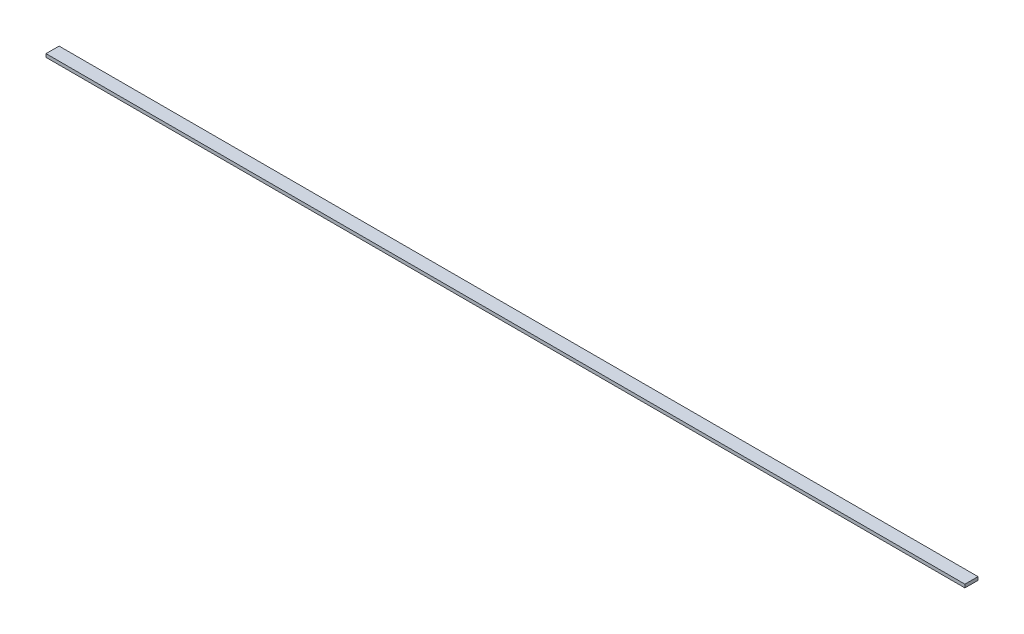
from build123d import *

# Parameters (mm, degrees)
SKETCH1_W           = 1784.35
SKETCH1_H           = 25.4
BOSS_EXTRUDE1_DEPTH = 6.35


with BuildPart() as part:
    # Sketch1 → Boss-Extrude1 (new body)
    with BuildSketch(Plane(origin=(0, 0, 0), x_dir=(1, 0, 0), z_dir=(0, 1, 0))):
        Rectangle(SKETCH1_W, SKETCH1_H)
    extrude(amount=BOSS_EXTRUDE1_DEPTH)


solid = part.part
